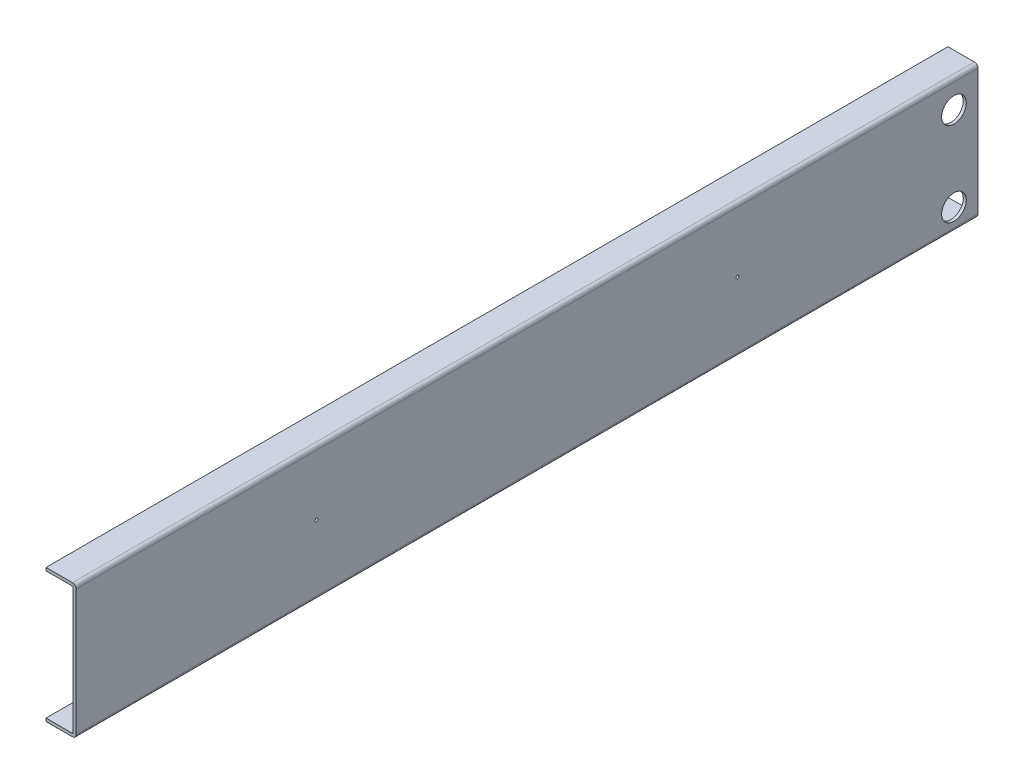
ISO-10303-21;
HEADER;
FILE_DESCRIPTION(('STEP AP214'),'2;1');
FILE_NAME('part.step','',(''),(''),'','','');
FILE_SCHEMA(('AUTOMOTIVE_DESIGN { 1 0 10303 214 1 1 1 1 }'));
ENDSEC;
DATA;
#1=APPLICATION_CONTEXT('core data for automotive mechanical design processes');
#2=APPLICATION_PROTOCOL_DEFINITION('international standard','automotive_design',2000,#1);
#3=PRODUCT_CONTEXT('',#1,'mechanical');
#4=PRODUCT('Part','Part','',(#3));
#5=PRODUCT_RELATED_PRODUCT_CATEGORY('part','',(#4));
#6=PRODUCT_DEFINITION_FORMATION('','',#4);
#7=PRODUCT_DEFINITION_CONTEXT('part definition',#1,'design');
#8=PRODUCT_DEFINITION('design','',#6,#7);
#9=PRODUCT_DEFINITION_SHAPE('','',#8);
#10=(LENGTH_UNIT() NAMED_UNIT(*) SI_UNIT(.MILLI.,.METRE.));
#11=(NAMED_UNIT(*) PLANE_ANGLE_UNIT() SI_UNIT($,.RADIAN.));
#12=(NAMED_UNIT(*) SI_UNIT($,.STERADIAN.) SOLID_ANGLE_UNIT());
#13=UNCERTAINTY_MEASURE_WITH_UNIT(LENGTH_MEASURE(1.E-05),#10,'distance_accuracy_value','');
#14=(GEOMETRIC_REPRESENTATION_CONTEXT(3) GLOBAL_UNCERTAINTY_ASSIGNED_CONTEXT((#13)) GLOBAL_UNIT_ASSIGNED_CONTEXT((#10,
#11,#12)) REPRESENTATION_CONTEXT('',''));
#15=CARTESIAN_POINT('',(0.,0.,0.));
#16=DIRECTION('',(0.,0.,1.));
#17=DIRECTION('',(1.,0.,0.));
#18=AXIS2_PLACEMENT_3D('',#15,#16,#17);
#19=CARTESIAN_POINT('',(0.,0.,1500.));
#20=DIRECTION('',(1.,0.,0.));
#21=DIRECTION('',(0.,1.,0.));
#22=AXIS2_PLACEMENT_3D('',#19,#20,#21);
#23=PLANE('',#22);
#24=DIRECTION('',(0.,-1.,0.));
#25=VECTOR('',#24,1.);
#26=CARTESIAN_POINT('',(0.,0.,0.));
#27=LINE('',#26,#25);
#28=CARTESIAN_POINT('',(0.,0.,0.));
#29=VERTEX_POINT('',#28);
#30=CARTESIAN_POINT('',(0.,-5.,0.));
#31=VERTEX_POINT('',#30);
#32=EDGE_CURVE('E121',#29,#31,#27,.T.);
#33=ORIENTED_EDGE('',*,*,#32,.T.);
#34=DIRECTION('',(0.,0.,-1.));
#35=VECTOR('',#34,1.);
#36=CARTESIAN_POINT('',(0.,-5.,1500.));
#37=LINE('',#36,#35);
#38=CARTESIAN_POINT('',(0.,-5.,1500.));
#39=VERTEX_POINT('',#38);
#40=EDGE_CURVE('E11',#39,#31,#37,.T.);
#41=ORIENTED_EDGE('',*,*,#40,.F.);
#42=DIRECTION('',(0.,-1.,0.));
#43=VECTOR('',#42,1.);
#44=CARTESIAN_POINT('',(0.,0.,1500.));
#45=LINE('',#44,#43);
#46=CARTESIAN_POINT('',(0.,0.,1500.));
#47=VERTEX_POINT('',#46);
#48=EDGE_CURVE('E161',#47,#39,#45,.T.);
#49=ORIENTED_EDGE('',*,*,#48,.F.);
#50=DIRECTION('',(0.,0.,-1.));
#51=VECTOR('',#50,1.);
#52=CARTESIAN_POINT('',(0.,0.,1500.));
#53=LINE('',#52,#51);
#54=EDGE_CURVE('E134',#47,#29,#53,.T.);
#55=ORIENTED_EDGE('',*,*,#54,.T.);
#56=EDGE_LOOP('',(#33,#41,#49,#55));
#57=FACE_BOUND('',#56,.T.);
#58=ADVANCED_FACE('F29',(#57),#23,.F.);
#59=CARTESIAN_POINT('',(0.,-5.,1500.));
#60=DIRECTION('',(0.,1.,0.));
#61=DIRECTION('',(-1.,0.,0.));
#62=AXIS2_PLACEMENT_3D('',#59,#60,#61);
#63=PLANE('',#62);
#64=DIRECTION('',(1.,0.,0.));
#65=VECTOR('',#64,1.);
#66=CARTESIAN_POINT('',(0.,-5.,0.));
#67=LINE('',#66,#65);
#68=CARTESIAN_POINT('',(44.,-5.,0.));
#69=VERTEX_POINT('',#68);
#70=EDGE_CURVE('E117',#31,#69,#67,.T.);
#71=ORIENTED_EDGE('',*,*,#70,.T.);
#72=DIRECTION('',(0.,0.,-1.));
#73=VECTOR('',#72,1.);
#74=CARTESIAN_POINT('',(44.,-5.,1500.));
#75=LINE('',#74,#73);
#76=CARTESIAN_POINT('',(44.,-5.,1500.));
#77=VERTEX_POINT('',#76);
#78=EDGE_CURVE('E36',#77,#69,#75,.T.);
#79=ORIENTED_EDGE('',*,*,#78,.F.);
#80=DIRECTION('',(1.,0.,0.));
#81=VECTOR('',#80,1.);
#82=CARTESIAN_POINT('',(0.,-5.,1500.));
#83=LINE('',#82,#81);
#84=EDGE_CURVE('E130',#39,#77,#83,.T.);
#85=ORIENTED_EDGE('',*,*,#84,.F.);
#86=ORIENTED_EDGE('',*,*,#40,.T.);
#87=EDGE_LOOP('',(#71,#79,#85,#86));
#88=FACE_BOUND('',#87,.T.);
#89=ADVANCED_FACE('F129',(#88),#63,.F.);
#90=CARTESIAN_POINT('',(44.,-6.,1500.));
#91=DIRECTION('',(0.,0.,-1.));
#92=DIRECTION('',(-1.,0.,0.));
#93=AXIS2_PLACEMENT_3D('',#90,#91,#92);
#94=CYLINDRICAL_SURFACE('',#93,1.);
#95=CARTESIAN_POINT('',(44.,-6.,0.));
#96=DIRECTION('',(0.,0.,-1.));
#97=DIRECTION('',(1.,0.,0.));
#98=AXIS2_PLACEMENT_3D('',#95,#96,#97);
#99=CIRCLE('',#98,1.);
#100=CARTESIAN_POINT('',(45.,-6.00000000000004,0.));
#101=VERTEX_POINT('',#100);
#102=EDGE_CURVE('E123',#69,#101,#99,.T.);
#103=ORIENTED_EDGE('',*,*,#102,.T.);
#104=DIRECTION('',(0.,0.,-1.));
#105=VECTOR('',#104,1.);
#106=CARTESIAN_POINT('',(45.,-6.00000000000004,1500.));
#107=LINE('',#106,#105);
#108=CARTESIAN_POINT('',(45.,-6.00000000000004,1500.));
#109=VERTEX_POINT('',#108);
#110=EDGE_CURVE('E207',#109,#101,#107,.T.);
#111=ORIENTED_EDGE('',*,*,#110,.F.);
#112=CARTESIAN_POINT('',(44.,-6.,1500.));
#113=DIRECTION('',(0.,0.,-1.));
#114=DIRECTION('',(1.,0.,0.));
#115=AXIS2_PLACEMENT_3D('',#112,#113,#114);
#116=CIRCLE('',#115,1.);
#117=EDGE_CURVE('E164',#77,#109,#116,.T.);
#118=ORIENTED_EDGE('',*,*,#117,.F.);
#119=ORIENTED_EDGE('',*,*,#78,.T.);
#120=EDGE_LOOP('',(#103,#111,#118,#119));
#121=FACE_BOUND('',#120,.T.);
#122=ADVANCED_FACE('F211',(#121),#94,.F.);
#123=CARTESIAN_POINT('',(45.,-6.00000000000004,1500.));
#124=DIRECTION('',(1.,0.,0.));
#125=DIRECTION('',(0.,1.,0.));
#126=AXIS2_PLACEMENT_3D('',#123,#124,#125);
#127=PLANE('',#126);
#128=CARTESIAN_POINT('',(45.,-106.783687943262,1100.));
#129=DIRECTION('',(1.,0.,0.));
#130=DIRECTION('',(0.,1.,0.));
#131=AXIS2_PLACEMENT_3D('',#128,#129,#130);
#132=CIRCLE('',#131,2.49999999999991);
#133=CARTESIAN_POINT('',(45.,-104.283687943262,1100.));
#134=VERTEX_POINT('',#133);
#135=EDGE_CURVE('E311',#134,#134,#132,.T.);
#136=ORIENTED_EDGE('',*,*,#135,.T.);
#137=EDGE_LOOP('',(#136));
#138=FACE_BOUND('',#137,.T.);
#139=CARTESIAN_POINT('',(45.,-106.783687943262,400.));
#140=DIRECTION('',(1.,0.,0.));
#141=DIRECTION('',(0.,1.,0.));
#142=AXIS2_PLACEMENT_3D('',#139,#140,#141);
#143=CIRCLE('',#142,2.50000000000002);
#144=CARTESIAN_POINT('',(45.,-104.283687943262,400.));
#145=VERTEX_POINT('',#144);
#146=EDGE_CURVE('E307',#145,#145,#143,.T.);
#147=ORIENTED_EDGE('',*,*,#146,.T.);
#148=EDGE_LOOP('',(#147));
#149=FACE_BOUND('',#148,.T.);
#150=CARTESIAN_POINT('',(45.,-186.,40.));
#151=DIRECTION('',(1.,0.,0.));
#152=DIRECTION('',(0.,1.,0.));
#153=AXIS2_PLACEMENT_3D('',#150,#151,#152);
#154=CIRCLE('',#153,20.5);
#155=CARTESIAN_POINT('',(45.,-165.5,40.));
#156=VERTEX_POINT('',#155);
#157=EDGE_CURVE('E302',#156,#156,#154,.T.);
#158=ORIENTED_EDGE('',*,*,#157,.T.);
#159=EDGE_LOOP('',(#158));
#160=FACE_BOUND('',#159,.T.);
#161=CARTESIAN_POINT('',(45.,-46.,40.));
#162=DIRECTION('',(1.,0.,0.));
#163=DIRECTION('',(0.,1.,0.));
#164=AXIS2_PLACEMENT_3D('',#161,#162,#163);
#165=CIRCLE('',#164,20.5);
#166=CARTESIAN_POINT('',(45.,-25.5,40.));
#167=VERTEX_POINT('',#166);
#168=EDGE_CURVE('E135',#167,#167,#165,.T.);
#169=ORIENTED_EDGE('',*,*,#168,.T.);
#170=EDGE_LOOP('',(#169));
#171=FACE_BOUND('',#170,.T.);
#172=DIRECTION('',(0.,-1.,0.));
#173=VECTOR('',#172,1.);
#174=CARTESIAN_POINT('',(45.,-6.00000000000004,0.));
#175=LINE('',#174,#173);
#176=CARTESIAN_POINT('',(45.0000000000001,-216.,0.));
#177=VERTEX_POINT('',#176);
#178=EDGE_CURVE('E143',#101,#177,#175,.T.);
#179=ORIENTED_EDGE('',*,*,#178,.T.);
#180=DIRECTION('',(0.,0.,-1.));
#181=VECTOR('',#180,1.);
#182=CARTESIAN_POINT('',(45.0000000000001,-216.,1500.));
#183=LINE('',#182,#181);
#184=CARTESIAN_POINT('',(45.0000000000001,-216.,1500.));
#185=VERTEX_POINT('',#184);
#186=EDGE_CURVE('E204',#185,#177,#183,.T.);
#187=ORIENTED_EDGE('',*,*,#186,.F.);
#188=DIRECTION('',(0.,-1.,0.));
#189=VECTOR('',#188,1.);
#190=CARTESIAN_POINT('',(45.,-6.00000000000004,1500.));
#191=LINE('',#190,#189);
#192=EDGE_CURVE('E166',#109,#185,#191,.T.);
#193=ORIENTED_EDGE('',*,*,#192,.F.);
#194=ORIENTED_EDGE('',*,*,#110,.T.);
#195=EDGE_LOOP('',(#179,#187,#193,#194));
#196=FACE_BOUND('',#195,.T.);
#197=ADVANCED_FACE('F219',(#138,#149,#160,#171,#196),#127,.F.);
#198=CARTESIAN_POINT('',(44.,-216.,1500.));
#199=DIRECTION('',(0.,0.,-1.));
#200=DIRECTION('',(-1.,0.,0.));
#201=AXIS2_PLACEMENT_3D('',#198,#199,#200);
#202=CYLINDRICAL_SURFACE('',#201,1.00000000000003);
#203=CARTESIAN_POINT('',(44.,-216.,0.));
#204=DIRECTION('',(0.,0.,-1.));
#205=DIRECTION('',(1.,0.,0.));
#206=AXIS2_PLACEMENT_3D('',#203,#204,#205);
#207=CIRCLE('',#206,1.00000000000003);
#208=CARTESIAN_POINT('',(44.,-217.,0.));
#209=VERTEX_POINT('',#208);
#210=EDGE_CURVE('E145',#177,#209,#207,.T.);
#211=ORIENTED_EDGE('',*,*,#210,.T.);
#212=DIRECTION('',(0.,0.,-1.));
#213=VECTOR('',#212,1.);
#214=CARTESIAN_POINT('',(44.,-217.,1500.));
#215=LINE('',#214,#213);
#216=CARTESIAN_POINT('',(44.,-217.,1500.));
#217=VERTEX_POINT('',#216);
#218=EDGE_CURVE('E201',#217,#209,#215,.T.);
#219=ORIENTED_EDGE('',*,*,#218,.F.);
#220=CARTESIAN_POINT('',(44.,-216.,1500.));
#221=DIRECTION('',(0.,0.,-1.));
#222=DIRECTION('',(1.,0.,0.));
#223=AXIS2_PLACEMENT_3D('',#220,#221,#222);
#224=CIRCLE('',#223,1.00000000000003);
#225=EDGE_CURVE('E168',#185,#217,#224,.T.);
#226=ORIENTED_EDGE('',*,*,#225,.F.);
#227=ORIENTED_EDGE('',*,*,#186,.T.);
#228=EDGE_LOOP('',(#211,#219,#226,#227));
#229=FACE_BOUND('',#228,.T.);
#230=ADVANCED_FACE('F222',(#229),#202,.F.);
#231=CARTESIAN_POINT('',(0.,-217.,1500.));
#232=DIRECTION('',(0.,-1.,0.));
#233=DIRECTION('',(1.,0.,0.));
#234=AXIS2_PLACEMENT_3D('',#231,#232,#233);
#235=PLANE('',#234);
#236=DIRECTION('',(-1.,0.,0.));
#237=VECTOR('',#236,1.);
#238=CARTESIAN_POINT('',(0.,-217.,0.));
#239=LINE('',#238,#237);
#240=CARTESIAN_POINT('',(0.,-217.,0.));
#241=VERTEX_POINT('',#240);
#242=EDGE_CURVE('E147',#209,#241,#239,.T.);
#243=ORIENTED_EDGE('',*,*,#242,.T.);
#244=DIRECTION('',(0.,0.,-1.));
#245=VECTOR('',#244,1.);
#246=CARTESIAN_POINT('',(0.,-217.,1500.));
#247=LINE('',#246,#245);
#248=CARTESIAN_POINT('',(0.,-217.,1500.));
#249=VERTEX_POINT('',#248);
#250=EDGE_CURVE('E198',#249,#241,#247,.T.);
#251=ORIENTED_EDGE('',*,*,#250,.F.);
#252=DIRECTION('',(-1.,0.,0.));
#253=VECTOR('',#252,1.);
#254=CARTESIAN_POINT('',(0.,-217.,1500.));
#255=LINE('',#254,#253);
#256=EDGE_CURVE('E170',#217,#249,#255,.T.);
#257=ORIENTED_EDGE('',*,*,#256,.F.);
#258=ORIENTED_EDGE('',*,*,#218,.T.);
#259=EDGE_LOOP('',(#243,#251,#257,#258));
#260=FACE_BOUND('',#259,.T.);
#261=ADVANCED_FACE('F227',(#260),#235,.F.);
#262=CARTESIAN_POINT('',(0.,-222.,1500.));
#263=DIRECTION('',(1.,0.,0.));
#264=DIRECTION('',(0.,0.,-1.));
#265=AXIS2_PLACEMENT_3D('',#262,#263,#264);
#266=PLANE('',#265);
#267=DIRECTION('',(0.,-1.,0.));
#268=VECTOR('',#267,1.);
#269=CARTESIAN_POINT('',(0.,-222.,0.));
#270=LINE('',#269,#268);
#271=CARTESIAN_POINT('',(0.,-222.,0.));
#272=VERTEX_POINT('',#271);
#273=EDGE_CURVE('E149',#241,#272,#270,.T.);
#274=ORIENTED_EDGE('',*,*,#273,.T.);
#275=DIRECTION('',(0.,0.,-1.));
#276=VECTOR('',#275,1.);
#277=CARTESIAN_POINT('',(0.,-222.,1500.));
#278=LINE('',#277,#276);
#279=CARTESIAN_POINT('',(0.,-222.,1500.));
#280=VERTEX_POINT('',#279);
#281=EDGE_CURVE('E195',#280,#272,#278,.T.);
#282=ORIENTED_EDGE('',*,*,#281,.F.);
#283=DIRECTION('',(0.,-1.,0.));
#284=VECTOR('',#283,1.);
#285=CARTESIAN_POINT('',(0.,-222.,1500.));
#286=LINE('',#285,#284);
#287=EDGE_CURVE('E172',#249,#280,#286,.T.);
#288=ORIENTED_EDGE('',*,*,#287,.F.);
#289=ORIENTED_EDGE('',*,*,#250,.T.);
#290=EDGE_LOOP('',(#274,#282,#288,#289));
#291=FACE_BOUND('',#290,.T.);
#292=ADVANCED_FACE('F233',(#291),#266,.F.);
#293=CARTESIAN_POINT('',(44.,-222.,1500.));
#294=DIRECTION('',(0.,1.,0.));
#295=DIRECTION('',(-1.,0.,0.));
#296=AXIS2_PLACEMENT_3D('',#293,#294,#295);
#297=PLANE('',#296);
#298=DIRECTION('',(1.,0.,0.));
#299=VECTOR('',#298,1.);
#300=CARTESIAN_POINT('',(44.,-222.,0.));
#301=LINE('',#300,#299);
#302=CARTESIAN_POINT('',(44.,-222.,0.));
#303=VERTEX_POINT('',#302);
#304=EDGE_CURVE('E151',#272,#303,#301,.T.);
#305=ORIENTED_EDGE('',*,*,#304,.T.);
#306=DIRECTION('',(0.,0.,-1.));
#307=VECTOR('',#306,1.);
#308=CARTESIAN_POINT('',(44.,-222.,1500.));
#309=LINE('',#308,#307);
#310=CARTESIAN_POINT('',(44.,-222.,1500.));
#311=VERTEX_POINT('',#310);
#312=EDGE_CURVE('E192',#311,#303,#309,.T.);
#313=ORIENTED_EDGE('',*,*,#312,.F.);
#314=DIRECTION('',(1.,0.,0.));
#315=VECTOR('',#314,1.);
#316=CARTESIAN_POINT('',(44.,-222.,1500.));
#317=LINE('',#316,#315);
#318=EDGE_CURVE('E174',#280,#311,#317,.T.);
#319=ORIENTED_EDGE('',*,*,#318,.F.);
#320=ORIENTED_EDGE('',*,*,#281,.T.);
#321=EDGE_LOOP('',(#305,#313,#319,#320));
#322=FACE_BOUND('',#321,.T.);
#323=ADVANCED_FACE('F237',(#322),#297,.F.);
#324=CARTESIAN_POINT('',(44.,-216.,1500.));
#325=DIRECTION('',(0.,0.,-1.));
#326=DIRECTION('',(-1.,0.,0.));
#327=AXIS2_PLACEMENT_3D('',#324,#325,#326);
#328=CYLINDRICAL_SURFACE('',#327,6.);
#329=CARTESIAN_POINT('',(44.,-216.,0.));
#330=DIRECTION('',(0.,0.,1.));
#331=DIRECTION('',(1.,0.,0.));
#332=AXIS2_PLACEMENT_3D('',#329,#330,#331);
#333=CIRCLE('',#332,6.);
#334=CARTESIAN_POINT('',(50.,-216.,0.));
#335=VERTEX_POINT('',#334);
#336=EDGE_CURVE('E153',#303,#335,#333,.T.);
#337=ORIENTED_EDGE('',*,*,#336,.T.);
#338=DIRECTION('',(0.,0.,-1.));
#339=VECTOR('',#338,1.);
#340=CARTESIAN_POINT('',(50.,-216.,1500.));
#341=LINE('',#340,#339);
#342=CARTESIAN_POINT('',(50.,-216.,1500.));
#343=VERTEX_POINT('',#342);
#344=EDGE_CURVE('E189',#343,#335,#341,.T.);
#345=ORIENTED_EDGE('',*,*,#344,.F.);
#346=CARTESIAN_POINT('',(44.,-216.,1500.));
#347=DIRECTION('',(0.,0.,1.));
#348=DIRECTION('',(1.,0.,0.));
#349=AXIS2_PLACEMENT_3D('',#346,#347,#348);
#350=CIRCLE('',#349,6.);
#351=EDGE_CURVE('E176',#311,#343,#350,.T.);
#352=ORIENTED_EDGE('',*,*,#351,.F.);
#353=ORIENTED_EDGE('',*,*,#312,.T.);
#354=EDGE_LOOP('',(#337,#345,#352,#353));
#355=FACE_BOUND('',#354,.T.);
#356=ADVANCED_FACE('F242',(#355),#328,.T.);
#357=CARTESIAN_POINT('',(50.,-6.00000000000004,1500.));
#358=DIRECTION('',(-1.,0.,0.));
#359=DIRECTION('',(0.,-1.,0.));
#360=AXIS2_PLACEMENT_3D('',#357,#358,#359);
#361=PLANE('',#360);
#362=CARTESIAN_POINT('',(50.,-106.783687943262,1100.));
#363=DIRECTION('',(1.,0.,0.));
#364=DIRECTION('',(0.,1.,0.));
#365=AXIS2_PLACEMENT_3D('',#362,#363,#364);
#366=CIRCLE('',#365,2.49999999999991);
#367=CARTESIAN_POINT('',(50.,-104.283687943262,1100.));
#368=VERTEX_POINT('',#367);
#369=EDGE_CURVE('E290',#368,#368,#366,.T.);
#370=ORIENTED_EDGE('',*,*,#369,.F.);
#371=EDGE_LOOP('',(#370));
#372=FACE_BOUND('',#371,.T.);
#373=CARTESIAN_POINT('',(50.,-106.783687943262,400.));
#374=DIRECTION('',(1.,0.,0.));
#375=DIRECTION('',(0.,1.,0.));
#376=AXIS2_PLACEMENT_3D('',#373,#374,#375);
#377=CIRCLE('',#376,2.50000000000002);
#378=CARTESIAN_POINT('',(50.,-104.283687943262,400.));
#379=VERTEX_POINT('',#378);
#380=EDGE_CURVE('E294',#379,#379,#377,.T.);
#381=ORIENTED_EDGE('',*,*,#380,.F.);
#382=EDGE_LOOP('',(#381));
#383=FACE_BOUND('',#382,.T.);
#384=CARTESIAN_POINT('',(50.,-186.,40.));
#385=DIRECTION('',(1.,0.,0.));
#386=DIRECTION('',(0.,1.,0.));
#387=AXIS2_PLACEMENT_3D('',#384,#385,#386);
#388=CIRCLE('',#387,20.5);
#389=CARTESIAN_POINT('',(50.,-165.5,40.));
#390=VERTEX_POINT('',#389);
#391=EDGE_CURVE('E298',#390,#390,#388,.T.);
#392=ORIENTED_EDGE('',*,*,#391,.F.);
#393=EDGE_LOOP('',(#392));
#394=FACE_BOUND('',#393,.T.);
#395=CARTESIAN_POINT('',(50.,-46.,40.));
#396=DIRECTION('',(1.,0.,0.));
#397=DIRECTION('',(0.,1.,0.));
#398=AXIS2_PLACEMENT_3D('',#395,#396,#397);
#399=CIRCLE('',#398,20.5);
#400=CARTESIAN_POINT('',(50.,-25.5,40.));
#401=VERTEX_POINT('',#400);
#402=EDGE_CURVE('E138',#401,#401,#399,.T.);
#403=ORIENTED_EDGE('',*,*,#402,.F.);
#404=EDGE_LOOP('',(#403));
#405=FACE_BOUND('',#404,.T.);
#406=DIRECTION('',(0.,1.,0.));
#407=VECTOR('',#406,1.);
#408=CARTESIAN_POINT('',(50.,-6.00000000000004,0.));
#409=LINE('',#408,#407);
#410=CARTESIAN_POINT('',(50.,-6.00000000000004,0.));
#411=VERTEX_POINT('',#410);
#412=EDGE_CURVE('E155',#335,#411,#409,.T.);
#413=ORIENTED_EDGE('',*,*,#412,.T.);
#414=DIRECTION('',(0.,0.,-1.));
#415=VECTOR('',#414,1.);
#416=CARTESIAN_POINT('',(50.,-6.00000000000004,1500.));
#417=LINE('',#416,#415);
#418=CARTESIAN_POINT('',(50.,-6.00000000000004,1500.));
#419=VERTEX_POINT('',#418);
#420=EDGE_CURVE('E186',#419,#411,#417,.T.);
#421=ORIENTED_EDGE('',*,*,#420,.F.);
#422=DIRECTION('',(0.,1.,0.));
#423=VECTOR('',#422,1.);
#424=CARTESIAN_POINT('',(50.,-6.00000000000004,1500.));
#425=LINE('',#424,#423);
#426=EDGE_CURVE('E178',#343,#419,#425,.T.);
#427=ORIENTED_EDGE('',*,*,#426,.F.);
#428=ORIENTED_EDGE('',*,*,#344,.T.);
#429=EDGE_LOOP('',(#413,#421,#427,#428));
#430=FACE_BOUND('',#429,.T.);
#431=ADVANCED_FACE('F246',(#372,#383,#394,#405,#430),#361,.F.);
#432=CARTESIAN_POINT('',(44.,-6.,1500.));
#433=DIRECTION('',(0.,0.,-1.));
#434=DIRECTION('',(-1.,0.,0.));
#435=AXIS2_PLACEMENT_3D('',#432,#433,#434);
#436=CYLINDRICAL_SURFACE('',#435,6.);
#437=CARTESIAN_POINT('',(44.,-6.,0.));
#438=DIRECTION('',(0.,0.,1.));
#439=DIRECTION('',(1.,0.,0.));
#440=AXIS2_PLACEMENT_3D('',#437,#438,#439);
#441=CIRCLE('',#440,6.);
#442=CARTESIAN_POINT('',(44.,0.,0.));
#443=VERTEX_POINT('',#442);
#444=EDGE_CURVE('E157',#411,#443,#441,.T.);
#445=ORIENTED_EDGE('',*,*,#444,.T.);
#446=DIRECTION('',(0.,0.,-1.));
#447=VECTOR('',#446,1.);
#448=CARTESIAN_POINT('',(44.,0.,1500.));
#449=LINE('',#448,#447);
#450=CARTESIAN_POINT('',(44.,0.,1500.));
#451=VERTEX_POINT('',#450);
#452=EDGE_CURVE('E183',#451,#443,#449,.T.);
#453=ORIENTED_EDGE('',*,*,#452,.F.);
#454=CARTESIAN_POINT('',(44.,-6.,1500.));
#455=DIRECTION('',(0.,0.,1.));
#456=DIRECTION('',(1.,0.,0.));
#457=AXIS2_PLACEMENT_3D('',#454,#455,#456);
#458=CIRCLE('',#457,6.);
#459=EDGE_CURVE('E48',#419,#451,#458,.T.);
#460=ORIENTED_EDGE('',*,*,#459,.F.);
#461=ORIENTED_EDGE('',*,*,#420,.T.);
#462=EDGE_LOOP('',(#445,#453,#460,#461));
#463=FACE_BOUND('',#462,.T.);
#464=ADVANCED_FACE('F250',(#463),#436,.T.);
#465=CARTESIAN_POINT('',(0.,0.,1500.));
#466=DIRECTION('',(0.,-1.,0.));
#467=DIRECTION('',(0.,0.,-1.));
#468=AXIS2_PLACEMENT_3D('',#465,#466,#467);
#469=PLANE('',#468);
#470=DIRECTION('',(-1.,0.,0.));
#471=VECTOR('',#470,1.);
#472=CARTESIAN_POINT('',(0.,0.,0.));
#473=LINE('',#472,#471);
#474=EDGE_CURVE('E159',#443,#29,#473,.T.);
#475=ORIENTED_EDGE('',*,*,#474,.T.);
#476=ORIENTED_EDGE('',*,*,#54,.F.);
#477=DIRECTION('',(-1.,0.,0.));
#478=VECTOR('',#477,1.);
#479=CARTESIAN_POINT('',(0.,0.,1500.));
#480=LINE('',#479,#478);
#481=EDGE_CURVE('E43',#451,#47,#480,.T.);
#482=ORIENTED_EDGE('',*,*,#481,.F.);
#483=ORIENTED_EDGE('',*,*,#452,.T.);
#484=EDGE_LOOP('',(#475,#476,#482,#483));
#485=FACE_BOUND('',#484,.T.);
#486=ADVANCED_FACE('F252',(#485),#469,.F.);
#487=CARTESIAN_POINT('',(44.,-6.,1500.));
#488=DIRECTION('',(0.,0.,1.));
#489=DIRECTION('',(1.,0.,0.));
#490=AXIS2_PLACEMENT_3D('',#487,#488,#489);
#491=PLANE('',#490);
#492=ORIENTED_EDGE('',*,*,#48,.T.);
#493=ORIENTED_EDGE('',*,*,#84,.T.);
#494=ORIENTED_EDGE('',*,*,#117,.T.);
#495=ORIENTED_EDGE('',*,*,#192,.T.);
#496=ORIENTED_EDGE('',*,*,#225,.T.);
#497=ORIENTED_EDGE('',*,*,#256,.T.);
#498=ORIENTED_EDGE('',*,*,#287,.T.);
#499=ORIENTED_EDGE('',*,*,#318,.T.);
#500=ORIENTED_EDGE('',*,*,#351,.T.);
#501=ORIENTED_EDGE('',*,*,#426,.T.);
#502=ORIENTED_EDGE('',*,*,#459,.T.);
#503=ORIENTED_EDGE('',*,*,#481,.T.);
#504=EDGE_LOOP('',(#492,#493,#494,#495,#496,#497,#498,#499,#500,#501,#502,#503));
#505=FACE_BOUND('',#504,.T.);
#506=ADVANCED_FACE('F214',(#505),#491,.T.);
#507=CARTESIAN_POINT('',(44.,-6.,0.));
#508=DIRECTION('',(0.,0.,1.));
#509=DIRECTION('',(1.,0.,0.));
#510=AXIS2_PLACEMENT_3D('',#507,#508,#509);
#511=PLANE('',#510);
#512=ORIENTED_EDGE('',*,*,#32,.F.);
#513=ORIENTED_EDGE('',*,*,#474,.F.);
#514=ORIENTED_EDGE('',*,*,#444,.F.);
#515=ORIENTED_EDGE('',*,*,#412,.F.);
#516=ORIENTED_EDGE('',*,*,#336,.F.);
#517=ORIENTED_EDGE('',*,*,#304,.F.);
#518=ORIENTED_EDGE('',*,*,#273,.F.);
#519=ORIENTED_EDGE('',*,*,#242,.F.);
#520=ORIENTED_EDGE('',*,*,#210,.F.);
#521=ORIENTED_EDGE('',*,*,#178,.F.);
#522=ORIENTED_EDGE('',*,*,#102,.F.);
#523=ORIENTED_EDGE('',*,*,#70,.F.);
#524=EDGE_LOOP('',(#512,#513,#514,#515,#516,#517,#518,#519,#520,#521,#522,#523));
#525=FACE_BOUND('',#524,.T.);
#526=ADVANCED_FACE('F118',(#525),#511,.F.);
#527=CARTESIAN_POINT('',(40.,-46.,40.));
#528=DIRECTION('',(1.,0.,0.));
#529=DIRECTION('',(0.,1.,0.));
#530=AXIS2_PLACEMENT_3D('',#527,#528,#529);
#531=CYLINDRICAL_SURFACE('',#530,20.5);
#532=ORIENTED_EDGE('',*,*,#402,.T.);
#533=EDGE_LOOP('',(#532));
#534=FACE_BOUND('',#533,.T.);
#535=ORIENTED_EDGE('',*,*,#168,.F.);
#536=EDGE_LOOP('',(#535));
#537=FACE_BOUND('',#536,.T.);
#538=ADVANCED_FACE('F328',(#534,#537),#531,.F.);
#539=CARTESIAN_POINT('',(40.,-186.,40.));
#540=DIRECTION('',(1.,0.,0.));
#541=DIRECTION('',(0.,1.,0.));
#542=AXIS2_PLACEMENT_3D('',#539,#540,#541);
#543=CYLINDRICAL_SURFACE('',#542,20.5);
#544=ORIENTED_EDGE('',*,*,#391,.T.);
#545=EDGE_LOOP('',(#544));
#546=FACE_BOUND('',#545,.T.);
#547=ORIENTED_EDGE('',*,*,#157,.F.);
#548=EDGE_LOOP('',(#547));
#549=FACE_BOUND('',#548,.T.);
#550=ADVANCED_FACE('F330',(#546,#549),#543,.F.);
#551=CARTESIAN_POINT('',(40.,-106.783687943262,400.));
#552=DIRECTION('',(1.,0.,0.));
#553=DIRECTION('',(0.,1.,0.));
#554=AXIS2_PLACEMENT_3D('',#551,#552,#553);
#555=CYLINDRICAL_SURFACE('',#554,2.50000000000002);
#556=ORIENTED_EDGE('',*,*,#380,.T.);
#557=EDGE_LOOP('',(#556));
#558=FACE_BOUND('',#557,.T.);
#559=ORIENTED_EDGE('',*,*,#146,.F.);
#560=EDGE_LOOP('',(#559));
#561=FACE_BOUND('',#560,.T.);
#562=ADVANCED_FACE('F318',(#558,#561),#555,.F.);
#563=CARTESIAN_POINT('',(40.,-106.783687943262,1100.));
#564=DIRECTION('',(1.,0.,0.));
#565=DIRECTION('',(0.,1.,0.));
#566=AXIS2_PLACEMENT_3D('',#563,#564,#565);
#567=CYLINDRICAL_SURFACE('',#566,2.49999999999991);
#568=ORIENTED_EDGE('',*,*,#369,.T.);
#569=EDGE_LOOP('',(#568));
#570=FACE_BOUND('',#569,.T.);
#571=ORIENTED_EDGE('',*,*,#135,.F.);
#572=EDGE_LOOP('',(#571));
#573=FACE_BOUND('',#572,.T.);
#574=ADVANCED_FACE('F315',(#570,#573),#567,.F.);
#575=CLOSED_SHELL('',(#58,#89,#122,#197,#230,#261,#292,#323,#356,#431,#464,#486,#506,#526,#538,
#550,#562,#574));
#576=MANIFOLD_SOLID_BREP('B2',#575);
#577=ADVANCED_BREP_SHAPE_REPRESENTATION('',(#18,#576),#14);
#578=SHAPE_DEFINITION_REPRESENTATION(#9,#577);
ENDSEC;
END-ISO-10303-21;
